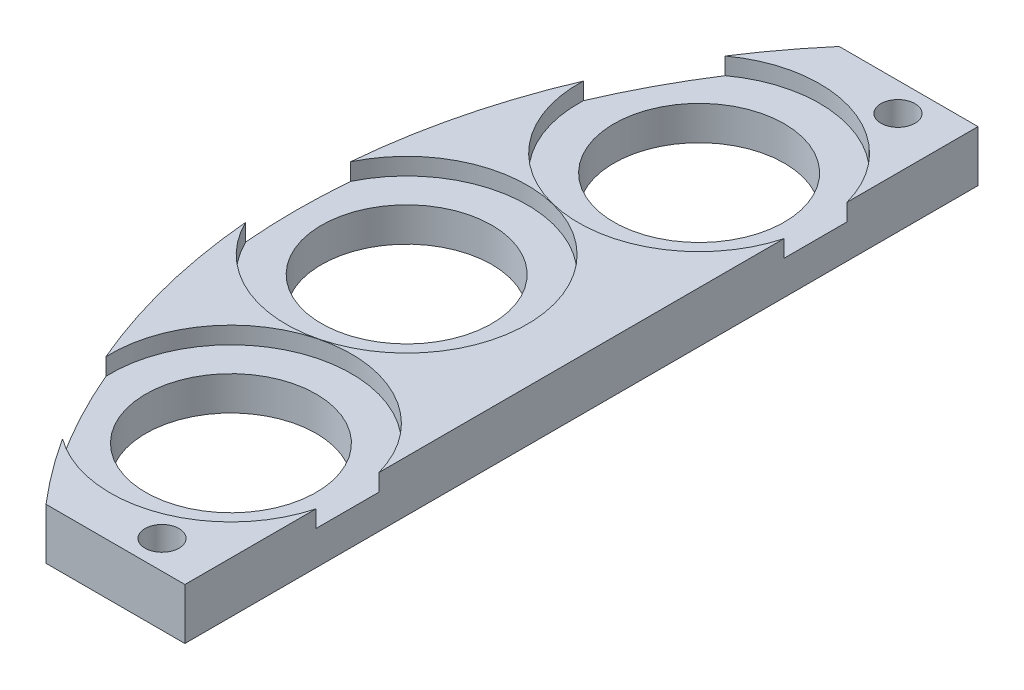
from build123d import *

# Parameters (mm, degrees)
SKETCH1_R                        = 7.9375
BOSS_EXTRUDE1_DEPTH              = 4.7625
SKETCH2_R                        = 11.2268
CUT_EXTRUDE1_DEPTH               = 1.5875
F_1_8_0_125_DIAMETER_HOLE1_D     = 3.175
F_1_8_0_125_DIAMETER_HOLE1_DEPTH = 22.352
F_1_8_0_125_DIAMETER_HOLE1_TIP   = 0.953866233


with BuildPart() as part:
    # Sketch1 → Boss-Extrude1 (new body)
    with BuildSketch(Plane(origin=(0, 0, 0), x_dir=(1, 0, 0), z_dir=(0, 1, 0))):
        with BuildLine():
            Line((-30.1625, 36.93795), (-30.1625, -36.92525))
            Line((-30.1625, -36.92525), (-43.098063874, -36.92525))
            ThreePointArc((-43.098063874, -36.92525), (-56.753124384, 0.008362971), (-43.087179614, 36.93795))
            Line((-43.087179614, 36.93795), (-30.1625, 36.93795))
        make_face()
        with Locations(Location((-46.434375, 0, 0), (0, 0, 90))):
            Circle(SKETCH1_R, mode=Mode.SUBTRACT)
        with Locations(Location((-40.999119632, 21.799618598, 0), (0, 0, 90))):
            Circle(SKETCH1_R, mode=Mode.SUBTRACT)
        with Locations(Location((-40.999119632, -21.799618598, 0), (0, 0, 90))):
            Circle(SKETCH1_R, mode=Mode.SUBTRACT)
    extrude(amount=BOSS_EXTRUDE1_DEPTH)

    # Sketch2 → Cut-Extrude1 (cut)
    with BuildSketch(Plane(origin=(0, 4.7625, 0), x_dir=(1, 0, 0), z_dir=(0, 1, 0))):
        with Locations((-40.999119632, 21.799618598)):
            Circle(SKETCH2_R)
        with Locations((-46.434375, 0)):
            Circle(SKETCH2_R)
        with Locations((-40.999119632, -21.799618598)):
            Circle(SKETCH2_R)
    extrude(amount=-CUT_EXTRUDE1_DEPTH, mode=Mode.SUBTRACT)

    # 1_8 _0.125_ Diameter Hole1
    with Locations(Plane(origin=(0, 4.7625, 0), x_dir=(1, 0, 0), z_dir=(0, 1, 0))):
        with Locations((-34.948790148, 34.27095), (-34.948790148, -34.27095)):
            Hole(F_1_8_0_125_DIAMETER_HOLE1_D / 2, depth=F_1_8_0_125_DIAMETER_HOLE1_DEPTH)
            with Locations((0, 0, -(F_1_8_0_125_DIAMETER_HOLE1_DEPTH + F_1_8_0_125_DIAMETER_HOLE1_TIP / 2))):  # 118° drill point
                Cone(0, F_1_8_0_125_DIAMETER_HOLE1_D / 2, F_1_8_0_125_DIAMETER_HOLE1_TIP, mode=Mode.SUBTRACT)


solid = part.part
